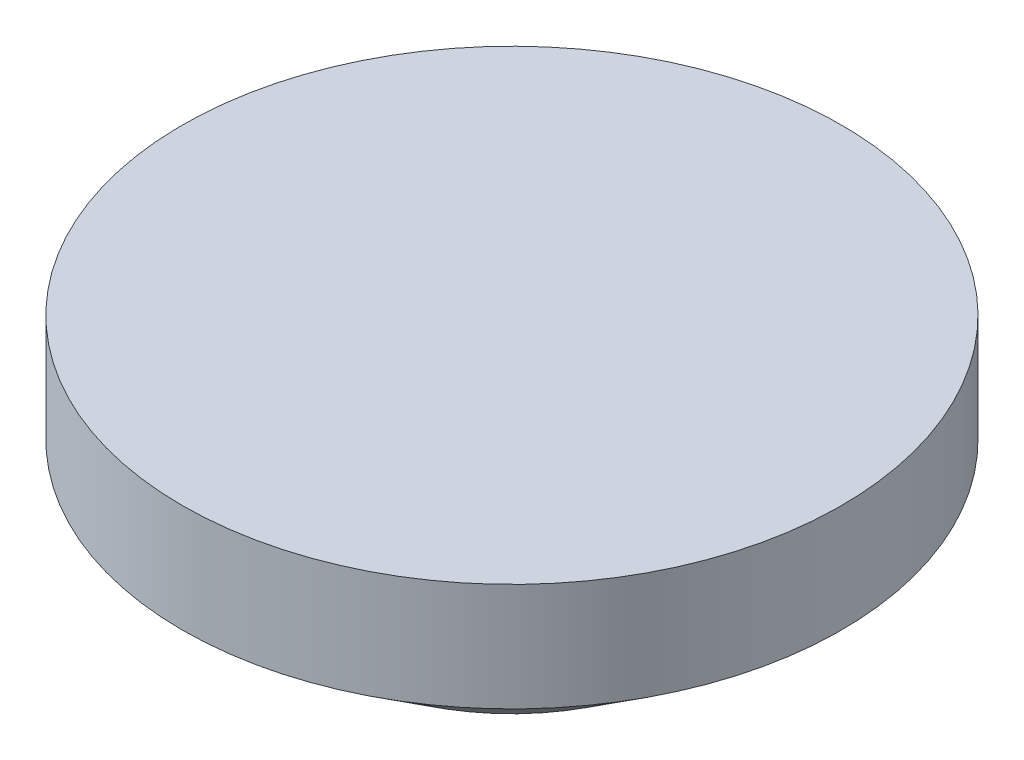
ISO-10303-21;
HEADER;
FILE_DESCRIPTION(('STEP AP214'),'2;1');
FILE_NAME('part.step','',(''),(''),'','','');
FILE_SCHEMA(('AUTOMOTIVE_DESIGN { 1 0 10303 214 1 1 1 1 }'));
ENDSEC;
DATA;
#1=APPLICATION_CONTEXT('core data for automotive mechanical design processes');
#2=APPLICATION_PROTOCOL_DEFINITION('international standard','automotive_design',2000,#1);
#3=PRODUCT_CONTEXT('',#1,'mechanical');
#4=PRODUCT('Part','Part','',(#3));
#5=PRODUCT_RELATED_PRODUCT_CATEGORY('part','',(#4));
#6=PRODUCT_DEFINITION_FORMATION('','',#4);
#7=PRODUCT_DEFINITION_CONTEXT('part definition',#1,'design');
#8=PRODUCT_DEFINITION('design','',#6,#7);
#9=PRODUCT_DEFINITION_SHAPE('','',#8);
#10=(LENGTH_UNIT() NAMED_UNIT(*) SI_UNIT(.MILLI.,.METRE.));
#11=(NAMED_UNIT(*) PLANE_ANGLE_UNIT() SI_UNIT($,.RADIAN.));
#12=(NAMED_UNIT(*) SI_UNIT($,.STERADIAN.) SOLID_ANGLE_UNIT());
#13=UNCERTAINTY_MEASURE_WITH_UNIT(LENGTH_MEASURE(1.E-05),#10,'distance_accuracy_value','');
#14=(GEOMETRIC_REPRESENTATION_CONTEXT(3) GLOBAL_UNCERTAINTY_ASSIGNED_CONTEXT((#13)) GLOBAL_UNIT_ASSIGNED_CONTEXT((#10,
#11,#12)) REPRESENTATION_CONTEXT('',''));
#15=CARTESIAN_POINT('',(0.,0.,0.));
#16=DIRECTION('',(0.,0.,1.));
#17=DIRECTION('',(1.,0.,0.));
#18=AXIS2_PLACEMENT_3D('',#15,#16,#17);
#19=CARTESIAN_POINT('',(0.,710.,0.));
#20=DIRECTION('',(0.,-1.,0.));
#21=DIRECTION('',(0.,0.,-1.));
#22=AXIS2_PLACEMENT_3D('',#19,#20,#21);
#23=PLANE('',#22);
#24=CARTESIAN_POINT('',(0.,710.,0.));
#25=DIRECTION('',(0.,1.,0.));
#26=DIRECTION('',(0.,0.,1.));
#27=AXIS2_PLACEMENT_3D('',#24,#25,#26);
#28=CIRCLE('',#27,1100.);
#29=CARTESIAN_POINT('',(0.,710.,1100.));
#30=VERTEX_POINT('',#29);
#31=EDGE_CURVE('E10',#30,#30,#28,.T.);
#32=ORIENTED_EDGE('',*,*,#31,.T.);
#33=EDGE_LOOP('',(#32));
#34=FACE_BOUND('',#33,.T.);
#35=ADVANCED_FACE('F33',(#34),#23,.F.);
#36=CARTESIAN_POINT('',(0.,710.,0.));
#37=DIRECTION('',(0.,1.,0.));
#38=DIRECTION('',(0.,0.,1.));
#39=AXIS2_PLACEMENT_3D('',#36,#37,#38);
#40=CYLINDRICAL_SURFACE('',#39,1100.);
#41=ORIENTED_EDGE('',*,*,#31,.F.);
#42=EDGE_LOOP('',(#41));
#43=FACE_BOUND('',#42,.T.);
#44=CARTESIAN_POINT('',(0.,350.,0.));
#45=DIRECTION('',(0.,1.,0.));
#46=DIRECTION('',(0.,0.,1.));
#47=AXIS2_PLACEMENT_3D('',#44,#45,#46);
#48=CIRCLE('',#47,1100.);
#49=CARTESIAN_POINT('',(0.,350.,1100.));
#50=VERTEX_POINT('',#49);
#51=EDGE_CURVE('E39',#50,#50,#48,.T.);
#52=ORIENTED_EDGE('',*,*,#51,.T.);
#53=EDGE_LOOP('',(#52));
#54=FACE_BOUND('',#53,.T.);
#55=ADVANCED_FACE('F58',(#43,#54),#40,.T.);
#56=CARTESIAN_POINT('',(0.,0.,0.));
#57=DIRECTION('',(0.,1.,0.));
#58=DIRECTION('',(0.,0.,1.));
#59=AXIS2_PLACEMENT_3D('',#56,#57,#58);
#60=CONICAL_SURFACE('',#59,625.,0.935769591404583);
#61=ORIENTED_EDGE('',*,*,#51,.F.);
#62=EDGE_LOOP('',(#61));
#63=FACE_BOUND('',#62,.T.);
#64=CARTESIAN_POINT('',(0.,0.,0.));
#65=DIRECTION('',(0.,1.,0.));
#66=DIRECTION('',(0.,0.,1.));
#67=AXIS2_PLACEMENT_3D('',#64,#65,#66);
#68=CIRCLE('',#67,625.);
#69=CARTESIAN_POINT('',(0.,0.,625.));
#70=VERTEX_POINT('',#69);
#71=EDGE_CURVE('E43',#70,#70,#68,.T.);
#72=ORIENTED_EDGE('',*,*,#71,.T.);
#73=EDGE_LOOP('',(#72));
#74=FACE_BOUND('',#73,.T.);
#75=ADVANCED_FACE('F50',(#63,#74),#60,.T.);
#76=CARTESIAN_POINT('',(625.,0.,0.));
#77=DIRECTION('',(0.,1.,0.));
#78=DIRECTION('',(0.,0.,1.));
#79=AXIS2_PLACEMENT_3D('',#76,#77,#78);
#80=PLANE('',#79);
#81=ORIENTED_EDGE('',*,*,#71,.F.);
#82=EDGE_LOOP('',(#81));
#83=FACE_BOUND('',#82,.T.);
#84=ADVANCED_FACE('F52',(#83),#80,.F.);
#85=CLOSED_SHELL('',(#35,#55,#75,#84));
#86=MANIFOLD_SOLID_BREP('B2',#85);
#87=ADVANCED_BREP_SHAPE_REPRESENTATION('',(#18,#86),#14);
#88=SHAPE_DEFINITION_REPRESENTATION(#9,#87);
ENDSEC;
END-ISO-10303-21;
